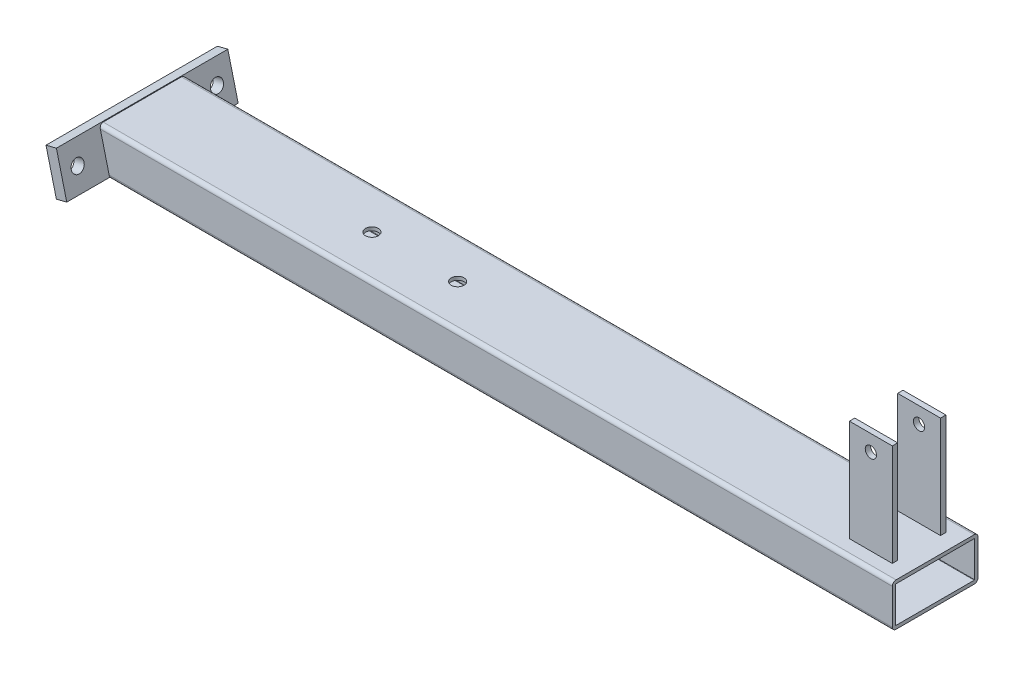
from build123d import *

# Parameters (mm, degrees)
EL_MENT_M_CANO_SOUD_1_DEPTH  = 740
ESQUISSE4_W                  = 141.939445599
ESQUISSE4_H                  = 78.321239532
ENL_V_MAT_EXTRU_1_DEPTH      = 10
ESQUISSE5_W                  = 160
ESQUISSE5_H                  = 40
ESQUISSE5_R                  = 6
BOSS_EXTRU_1_DEPTH           = 10
ESQUISSE6_W                  = 40
ESQUISSE6_H                  = 5
BOSS_EXTRU_2_DEPTH           = 95
BOSS_EXTRU_2_2_DEPTH         = 95
ENL_V_MAT_EXTRU_2_DEPTH      = 766.176478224
ENL_V_MAT_EXTRU_2_DEPTH_BACK = 766.176478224
ESQUISSE7_R                  = 5.25
ESQUISSE8_R                  = 6
ENL_V_MAT_EXTRU_3_DEPTH      = 767.09075365


with BuildPart() as part:
    # Sketch1 → El_ment m_cano-soud_1 (new body)
    with BuildSketch(Plane(origin=(0, 0, 0), x_dir=(0, 1, 0), z_dir=(-1, 0, 0))):
        with BuildLine():
            Line((-16.5, -40), (16.5, -40))
            ThreePointArc((16.5, -40), (18.974873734, -38.974873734), (20, -36.5))
            Line((20, -36.5), (20, 36.5))
            ThreePointArc((20, 36.5), (18.974873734, 38.974873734), (16.5, 40))
            Line((16.5, 40), (-16.5, 40))
            ThreePointArc((-16.5, 40), (-18.974873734, 38.974873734), (-20, 36.5))
            Line((-20, 36.5), (-20, -36.5))
            ThreePointArc((-20, -36.5), (-18.974873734, -38.974873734), (-16.5, -40))
        make_face()
        with BuildLine():
            Line((-16.5, -36.8), (16.5, -36.8))
            ThreePointArc((16.5, -36.8), (16.712132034, -36.712132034), (16.8, -36.5))
            Line((16.8, -36.5), (16.8, 36.5))
            ThreePointArc((16.8, 36.5), (16.712132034, 36.712132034), (16.5, 36.8))
            Line((16.5, 36.8), (-16.5, 36.8))
            ThreePointArc((-16.5, 36.8), (-16.712132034, 36.712132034), (-16.8, 36.5))
            Line((-16.8, 36.5), (-16.8, -36.5))
            ThreePointArc((-16.8, -36.5), (-16.712132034, -36.712132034), (-16.5, -36.8))
        make_face(mode=Mode.SUBTRACT)
    extrude(amount=EL_MENT_M_CANO_SOUD_1_DEPTH)

    # Esquisse4 → Enl_v. mat.-Extru.1 (cut)
    with BuildSketch(Plane(origin=(-691.99589373, -172.533954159, 0), x_dir=(0, 0, 1), z_dir=(-0.9702957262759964, -0.24192189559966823, 0))):
        with Locations((-3.457099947, 180.185170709)):
            Rectangle(ESQUISSE4_W, ESQUISSE4_H)
    extrude(amount=ENL_V_MAT_EXTRU_1_DEPTH, mode=Mode.SUBTRACT)

    # Esquisse8 → Enl_v. mat.-Extru.3 (cut, through all)
    with BuildSketch(Plane.XZ.offset(20)):
        with Locations(Location((-445.643855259, 0, 0), (0, 0, 270))):
            Circle(ESQUISSE8_R)
        with Locations(Location((-525.643855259, 0, 0), (0, 0, 270))):
            Circle(ESQUISSE8_R)
    extrude(amount=-ENL_V_MAT_EXTRU_3_DEPTH, mode=Mode.SUBTRACT)


with BuildPart() as body_2:
    # Esquisse5 → Boss.-Extru.1 (new body)
    with BuildSketch(Plane(origin=(-691.99589373, -172.533954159, 0), x_dir=(0, 0, 1), z_dir=(-0.9702957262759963, -0.24192189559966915, 0))):
        with Locations((0, 179.022202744)):
            Rectangle(ESQUISSE5_W, ESQUISSE5_H)
        with Locations(Location((-65, 179.022202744, 0), (0, 0, 270))):
            Circle(ESQUISSE5_R, mode=Mode.SUBTRACT)
        with Locations(Location((65, 179.022202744, 0), (0, 0, 270))):
            Circle(ESQUISSE5_R, mode=Mode.SUBTRACT)
    extrude(amount=BOSS_EXTRU_1_DEPTH)


with BuildPart() as body_3:
    # Esquisse6 → Boss.-Extru.2 (new body)
    with BuildSketch(Plane(origin=(0, 20, 0), x_dir=(1, 0, 0), z_dir=(0, 1, 0))):
        with Locations((-35, 22.5)):
            Rectangle(ESQUISSE6_W, ESQUISSE6_H)
    extrude(amount=BOSS_EXTRU_2_DEPTH)


with BuildPart() as body_4:
    # Esquisse6 → Boss.-Extru.2 2 (new body)
    with BuildSketch(Plane(origin=(0, 20, 0), x_dir=(1, 0, 0), z_dir=(0, 1, 0))):
        with Locations((-35, -22.5)):
            Rectangle(ESQUISSE6_W, ESQUISSE6_H)
    extrude(amount=BOSS_EXTRU_2_2_DEPTH)


with BuildPart() as enl_v_mat_extru_2_tool:
    # Esquisse7 → Enl_v. mat.-Extru.2 (new, two sides: drawn at the far end of the back side and taken through both)
    with BuildSketch(Plane.XY.offset(-20).offset(-ENL_V_MAT_EXTRU_2_DEPTH_BACK)):
        with Locations(Location((-35, 100, 0), (0, 0, 270))):
            Circle(ESQUISSE7_R)
    extrude(amount=ENL_V_MAT_EXTRU_2_DEPTH + ENL_V_MAT_EXTRU_2_DEPTH_BACK)


with BuildPart() as body_3_1:
    add(body_3.part)

    # Enl_v. mat.-Extru.2: cut by enl_v_mat_extru_2_tool
    add(enl_v_mat_extru_2_tool.part, mode=Mode.SUBTRACT)


with BuildPart() as body_4_1:
    add(body_4.part)

    # Enl_v. mat.-Extru.2: cut by enl_v_mat_extru_2_tool
    add(enl_v_mat_extru_2_tool.part, mode=Mode.SUBTRACT)


solid = Compound([part.part, body_2.part, body_3_1.part, body_4_1.part])
